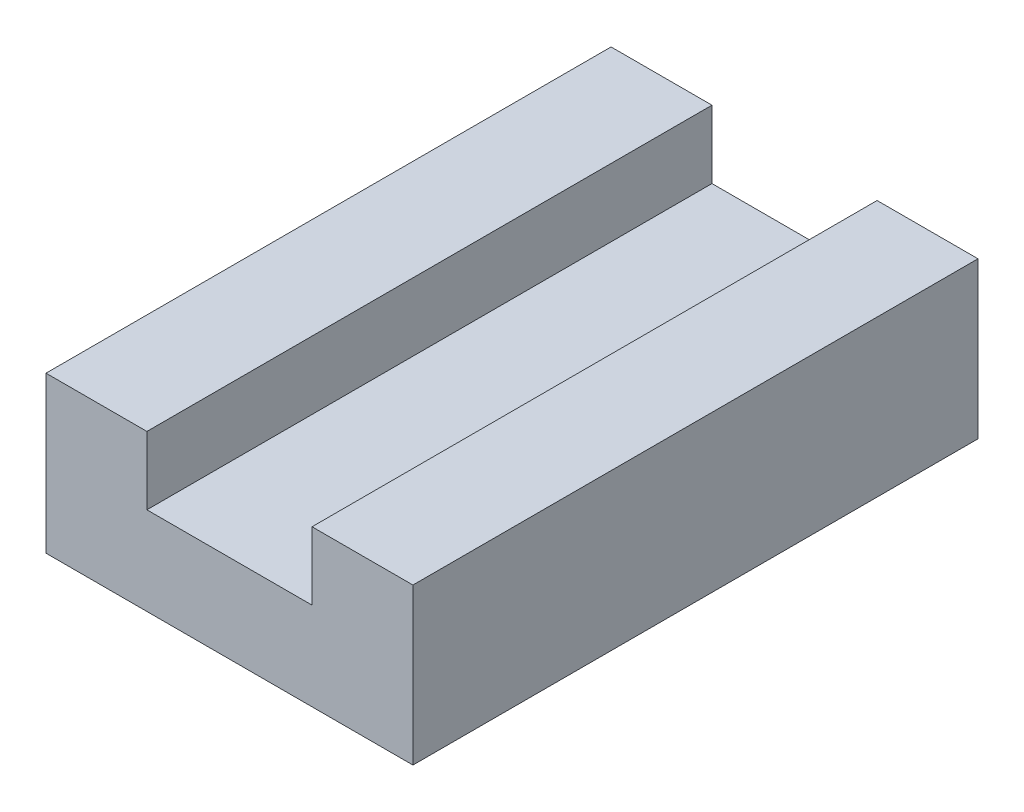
from build123d import *

# Parameters (mm, degrees)
SKETCH1_W                 = 30.8
SKETCH1_H                 = 8.5
BOSS_EXTRUDE1_DEPTH       = 10
SKETCH2_W                 = 9
SKETCH2_H                 = 30.8
CUT_EXTRUDE1_DEPTH        = 3.7
M3X0_5_TAPPED_HOLE1_D     = 2.5
M3X0_5_TAPPED_HOLE1_DEPTH = 2.8
M3X0_5_TAPPED_HOLE1_TIP   = 0.751075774


with BuildPart() as part:
    # Sketch1 → Boss-Extrude1 (new, symmetric)
    with BuildSketch(Plane(origin=(0, 0, 0), x_dir=(0, 0, -1), z_dir=(1, 0, 0))):
        with Locations((15.4, 4.25)):
            Rectangle(SKETCH1_W, SKETCH1_H)
    extrude(amount=BOSS_EXTRUDE1_DEPTH, both=True)

    # Sketch2 → Cut-Extrude1 (cut)
    with BuildSketch(Plane(origin=(0, 8.5, 0), x_dir=(1, 0, 0), z_dir=(0, 1, 0))):
        with Locations((0, 15.4)):
            Rectangle(SKETCH2_W, SKETCH2_H)
    extrude(amount=-CUT_EXTRUDE1_DEPTH, mode=Mode.SUBTRACT)

    # M3x0.5 Tapped Hole1
    with Locations(Plane(origin=(0, 0, 0), x_dir=(-1, 0, 0), z_dir=(0, -1, 0))):
        with Locations((7.5, 10.4), (7.5, 20.4), (-7.5, 20.4), (-7.5, 10.4)):
            Hole(M3X0_5_TAPPED_HOLE1_D / 2, depth=M3X0_5_TAPPED_HOLE1_DEPTH)
            with Locations((0, 0, -(M3X0_5_TAPPED_HOLE1_DEPTH + M3X0_5_TAPPED_HOLE1_TIP / 2))):  # 118° drill point
                Cone(0, M3X0_5_TAPPED_HOLE1_D / 2, M3X0_5_TAPPED_HOLE1_TIP, mode=Mode.SUBTRACT)


solid = part.part
